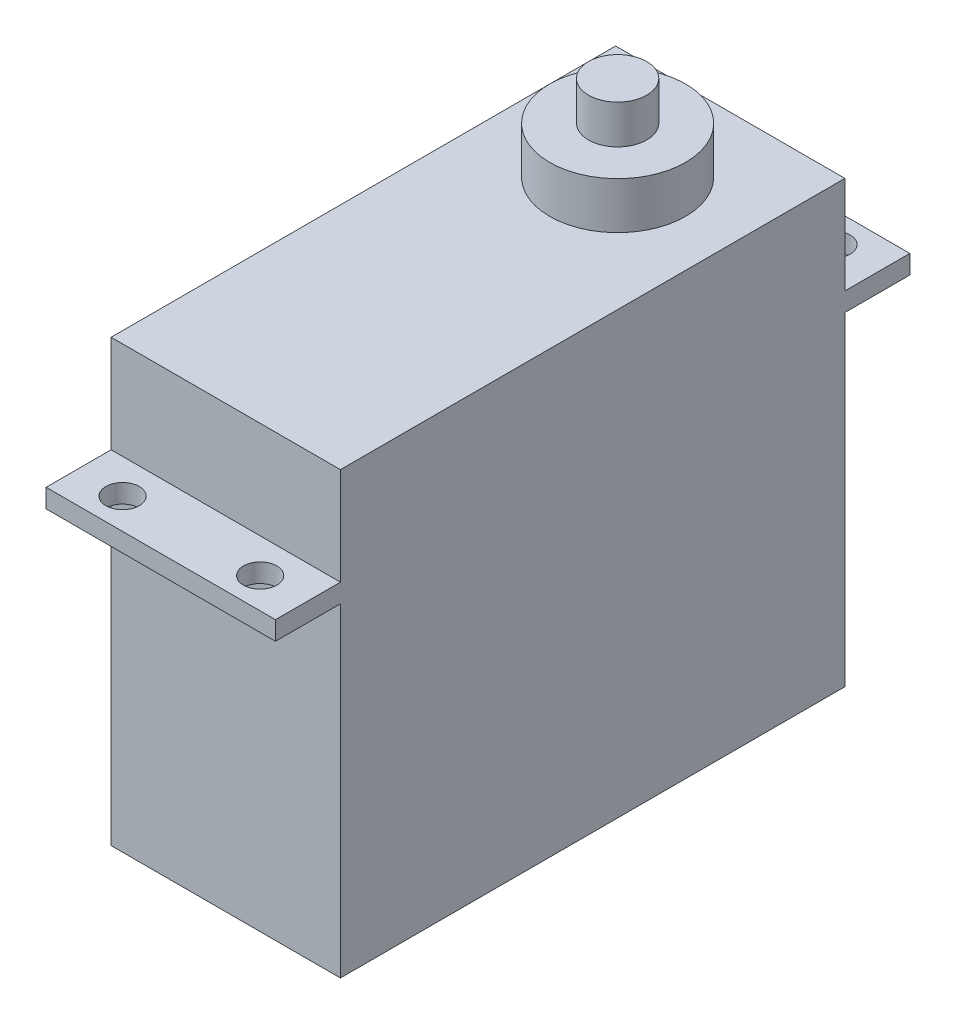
from build123d import *

# Parameters (mm, degrees)
SKETCH1_W               = 30
SKETCH1_H               = 66
EXTRUDE1_DEPTH          = 57.6
SKETCH3_W               = 30
SKETCH3_H               = 2.45
EXTRUDE3_DEPTH          = 8.5
SKETCH5_R               = 2.1844
CUT_EXTRUDE1_DEPTH      = 63.918777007
MIRROR3_COPY_1_SKETCH_R = 2.1844
MIRROR3_COPY_1_DEPTH    = 63.918777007
SKETCH4_R               = 8.89
EXTRUDE4_DEPTH          = 6.12
SKETCH6_R               = 3.81
EXTRUDE5_DEPTH          = 5.08


with BuildPart() as part:
    # Sketch1 → Extrude1 (new body)
    with BuildSketch(Plane(origin=(0, 0, 0), x_dir=(1, 0, 0), z_dir=(0, 1, 0))):
        Rectangle(SKETCH1_W, SKETCH1_H)
    extrude(amount=EXTRUDE1_DEPTH)

    # Sketch3 → Extrude3 (add)
    with BuildSketch(Plane.XY.offset(33)):
        with Locations((0, 43.625)):
            Rectangle(SKETCH3_W, SKETCH3_H)
    extrude3 = extrude(amount=EXTRUDE3_DEPTH)

    # Mirror1: Extrude3 across plane
    add(extrude3.mirror(Plane.XY))

    # Sketch5 → Cut-Extrude1 (cut, through all)
    with BuildSketch(Plane(origin=(0, 44.85, 0), x_dir=(1, 0, 0), z_dir=(0, 1, 0))):
        with Locations(Location((9, -37.5, 0), (0, 0, 270))):
            Circle(SKETCH5_R)
    cut_extrude1 = extrude(amount=-CUT_EXTRUDE1_DEPTH, mode=Mode.SUBTRACT)

    # Mirror2: Cut-Extrude1 across plane
    add(cut_extrude1.mirror(Plane.XY), mode=Mode.SUBTRACT)

    # Mirror3: Cut-Extrude1 across plane
    add(cut_extrude1.mirror(Plane(origin=(0, 0, 0), x_dir=(0, 0, 1), z_dir=(1, 0, 0))), mode=Mode.SUBTRACT)

    # Mirror3 copy 1 sketch → Mirror3 copy 1 (cut, through all)
    with BuildSketch(Plane(origin=(0, 44.85, 0), x_dir=(-1, 0, 0), z_dir=(0, 1, 0))):
        with Locations(Location((9, -37.5, 0), (0, 0, 270))):
            Circle(MIRROR3_COPY_1_SKETCH_R)
    extrude(amount=-MIRROR3_COPY_1_DEPTH, mode=Mode.SUBTRACT)

    # Sketch4 → Extrude4 (add)
    with BuildSketch(Plane(origin=(0, 57.6, 0), x_dir=(1, 0, 0), z_dir=(0, 1, 0))):
        with Locations(Location((0, 18.268, 0), (0, 0, 270))):
            Circle(SKETCH4_R)
    extrude(amount=EXTRUDE4_DEPTH)

    # Sketch6 → Extrude5 (add)
    with BuildSketch(Plane(origin=(0, 63.72, 0), x_dir=(1, 0, 0), z_dir=(0, 1, 0))):
        with Locations(Location((0, 18.268, 0), (0, 0, 270))):
            Circle(SKETCH6_R)
    extrude(amount=EXTRUDE5_DEPTH)


solid = part.part
